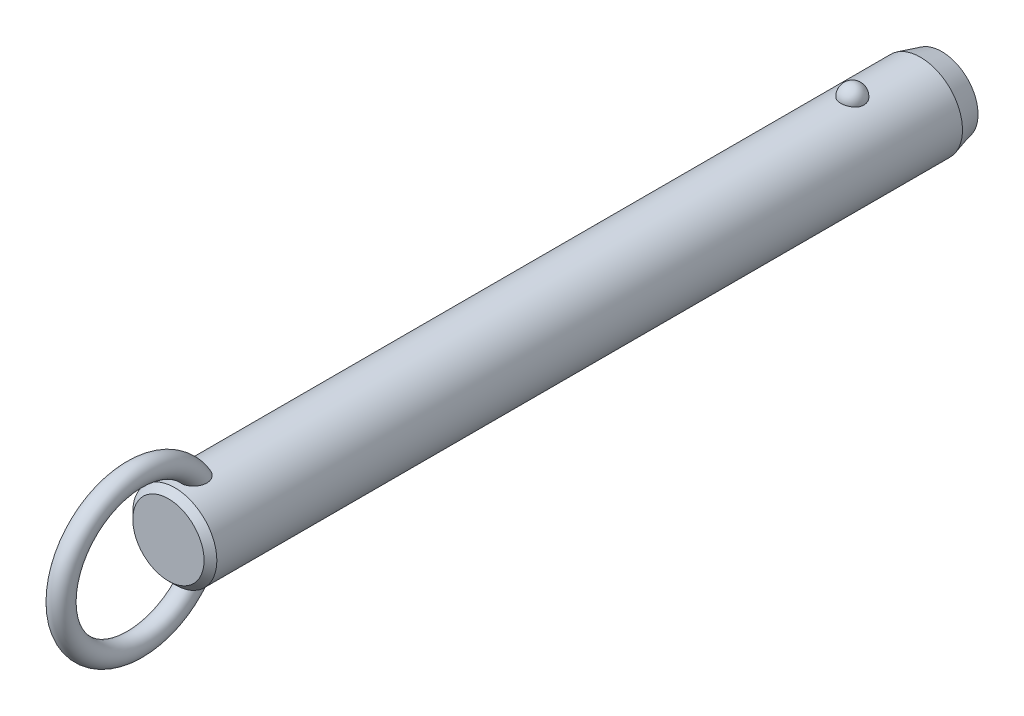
ISO-10303-21;
HEADER;
FILE_DESCRIPTION(('STEP AP214'),'2;1');
FILE_NAME('part.step','',(''),(''),'','','');
FILE_SCHEMA(('AUTOMOTIVE_DESIGN { 1 0 10303 214 1 1 1 1 }'));
ENDSEC;
DATA;
#1=APPLICATION_CONTEXT('core data for automotive mechanical design processes');
#2=APPLICATION_PROTOCOL_DEFINITION('international standard','automotive_design',2000,#1);
#3=PRODUCT_CONTEXT('',#1,'mechanical');
#4=PRODUCT('Part','Part','',(#3));
#5=PRODUCT_RELATED_PRODUCT_CATEGORY('part','',(#4));
#6=PRODUCT_DEFINITION_FORMATION('','',#4);
#7=PRODUCT_DEFINITION_CONTEXT('part definition',#1,'design');
#8=PRODUCT_DEFINITION('design','',#6,#7);
#9=PRODUCT_DEFINITION_SHAPE('','',#8);
#10=(LENGTH_UNIT() NAMED_UNIT(*) SI_UNIT(.MILLI.,.METRE.));
#11=(NAMED_UNIT(*) PLANE_ANGLE_UNIT() SI_UNIT($,.RADIAN.));
#12=(NAMED_UNIT(*) SI_UNIT($,.STERADIAN.) SOLID_ANGLE_UNIT());
#13=UNCERTAINTY_MEASURE_WITH_UNIT(LENGTH_MEASURE(1.E-05),#10,'distance_accuracy_value','');
#14=(GEOMETRIC_REPRESENTATION_CONTEXT(3) GLOBAL_UNCERTAINTY_ASSIGNED_CONTEXT((#13)) GLOBAL_UNIT_ASSIGNED_CONTEXT((#10,
#11,#12)) REPRESENTATION_CONTEXT('',''));
#15=CARTESIAN_POINT('',(0.,0.,0.));
#16=DIRECTION('',(0.,0.,1.));
#17=DIRECTION('',(1.,0.,0.));
#18=AXIS2_PLACEMENT_3D('',#15,#16,#17);
#19=CARTESIAN_POINT('',(0.,0.,116.8));
#20=DIRECTION('',(0.,0.,-1.));
#21=DIRECTION('',(-1.,0.,0.));
#22=AXIS2_PLACEMENT_3D('',#19,#20,#21);
#23=CYLINDRICAL_SURFACE('',#22,7.9);
#24=CARTESIAN_POINT('',(2.1785689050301,7.59367088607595,-2.19999999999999));
#25=CARTESIAN_POINT('',(2.17856679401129,7.59367269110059,-2.07701843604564));
#26=CARTESIAN_POINT('',(2.16853481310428,7.59657145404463,-1.95401006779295));
#27=CARTESIAN_POINT('',(2.12864689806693,7.607843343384,-1.71147811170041));
#28=CARTESIAN_POINT('',(2.09878338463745,7.61621856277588,-1.59195587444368));
#29=CARTESIAN_POINT('',(2.0199931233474,7.63749180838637,-1.3598563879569));
#30=CARTESIAN_POINT('',(1.97107475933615,7.6503878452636,-1.24727610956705));
#31=CARTESIAN_POINT('',(1.85539377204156,7.67926115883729,-1.03213234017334));
#32=CARTESIAN_POINT('',(1.78863158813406,7.69523835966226,-0.929568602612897));
#33=CARTESIAN_POINT('',(1.63856494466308,7.7285848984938,-0.736786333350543));
#34=CARTESIAN_POINT('',(1.55518140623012,7.7459606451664,-0.646630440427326));
#35=CARTESIAN_POINT('',(1.37422937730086,7.78009978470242,-0.481747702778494));
#36=CARTESIAN_POINT('',(1.27666086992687,7.79686317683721,-0.407020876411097));
#37=CARTESIAN_POINT('',(1.07024728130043,7.82786153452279,-0.275278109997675));
#38=CARTESIAN_POINT('',(0.961434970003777,7.84210353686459,-0.218212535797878));
#39=CARTESIAN_POINT('',(0.735351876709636,7.86652194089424,-0.123146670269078));
#40=CARTESIAN_POINT('',(0.618082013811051,7.87669878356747,-0.085144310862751));
#41=CARTESIAN_POINT('',(0.380637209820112,7.89170521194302,-0.0298158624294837));
#42=CARTESIAN_POINT('',(0.260550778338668,7.89662650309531,-0.0121347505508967));
#43=CARTESIAN_POINT('',(0.0190117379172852,7.90090003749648,0.00324379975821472));
#44=CARTESIAN_POINT('',(-0.102440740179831,7.90025280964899,0.00094313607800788));
#45=CARTESIAN_POINT('',(-0.341452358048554,7.89351056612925,-0.0233955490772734));
#46=CARTESIAN_POINT('',(-0.459042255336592,7.88749257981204,-0.0451545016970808));
#47=CARTESIAN_POINT('',(-0.688796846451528,7.87075812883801,-0.107408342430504));
#48=CARTESIAN_POINT('',(-0.800961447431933,7.86004158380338,-0.147903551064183));
#49=CARTESIAN_POINT('',(-1.01743634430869,7.83497131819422,-0.246799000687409));
#50=CARTESIAN_POINT('',(-1.12169791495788,7.82059709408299,-0.305300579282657));
#51=CARTESIAN_POINT('',(-1.31891765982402,7.78976470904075,-0.438549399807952));
#52=CARTESIAN_POINT('',(-1.41187469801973,7.77330633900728,-0.513298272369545));
#53=CARTESIAN_POINT('',(-1.58577142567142,7.73972434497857,-0.678622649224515));
#54=CARTESIAN_POINT('',(-1.66645140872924,7.72259402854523,-0.769470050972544));
#55=CARTESIAN_POINT('',(-1.81161503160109,7.68983776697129,-0.963538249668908));
#56=CARTESIAN_POINT('',(-1.87609753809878,7.6742119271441,-1.06675991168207));
#57=CARTESIAN_POINT('',(-1.98790138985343,7.6460202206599,-1.28401170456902));
#58=CARTESIAN_POINT('',(-2.03501994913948,7.63349104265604,-1.39815107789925));
#59=CARTESIAN_POINT('',(-2.10986724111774,7.6131449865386,-1.63301784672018));
#60=CARTESIAN_POINT('',(-2.1375965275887,7.60532797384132,-1.75374505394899));
#61=CARTESIAN_POINT('',(-2.17289256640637,7.5953195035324,-1.99782562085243));
#62=CARTESIAN_POINT('',(-2.18054294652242,7.59310471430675,-2.12116592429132));
#63=CARTESIAN_POINT('',(-2.17572919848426,7.59448538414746,-2.36741799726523));
#64=CARTESIAN_POINT('',(-2.1632656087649,7.59808068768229,-2.49032977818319));
#65=CARTESIAN_POINT('',(-2.11865035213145,7.61064035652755,-2.73161015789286));
#66=CARTESIAN_POINT('',(-2.08659579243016,7.61957823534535,-2.84999812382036));
#67=CARTESIAN_POINT('',(-2.00367799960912,7.64179982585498,-3.07955956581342));
#68=CARTESIAN_POINT('',(-1.9528140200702,7.65508371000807,-3.19073275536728));
#69=CARTESIAN_POINT('',(-1.83321113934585,7.68460381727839,-3.40337899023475));
#70=CARTESIAN_POINT('',(-1.76437735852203,7.70085556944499,-3.50479651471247));
#71=CARTESIAN_POINT('',(-1.61069526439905,7.73445734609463,-3.69446912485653));
#72=CARTESIAN_POINT('',(-1.52584634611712,7.75180741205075,-3.78272371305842));
#73=CARTESIAN_POINT('',(-1.34198059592,7.78574608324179,-3.94393987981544));
#74=CARTESIAN_POINT('',(-1.24291308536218,7.80233167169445,-4.01684434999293));
#75=CARTESIAN_POINT('',(-1.03352039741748,7.83281625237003,-4.14489386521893));
#76=CARTESIAN_POINT('',(-0.92319600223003,7.84671543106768,-4.20004014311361));
#77=CARTESIAN_POINT('',(-0.695822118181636,7.87011575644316,-4.29042017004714));
#78=CARTESIAN_POINT('',(-0.578872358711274,7.87966903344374,-4.32589112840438));
#79=CARTESIAN_POINT('',(-0.340410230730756,7.8935652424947,-4.37692226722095));
#80=CARTESIAN_POINT('',(-0.218898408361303,7.89790879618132,-4.39248482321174));
#81=CARTESIAN_POINT('',(0.0228107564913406,7.90087453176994,-4.40314405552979));
#82=CARTESIAN_POINT('',(0.142990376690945,7.89960185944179,-4.39861683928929));
#83=CARTESIAN_POINT('',(0.380829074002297,7.89171262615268,-4.37008293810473));
#84=CARTESIAN_POINT('',(0.498488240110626,7.8850962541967,-4.34607694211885));
#85=CARTESIAN_POINT('',(0.727535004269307,7.86726442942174,-4.27939317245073));
#86=CARTESIAN_POINT('',(0.838944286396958,7.85606616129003,-4.236785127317));
#87=CARTESIAN_POINT('',(1.05295421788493,7.83025654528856,-4.13408348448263));
#88=CARTESIAN_POINT('',(1.15555431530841,7.81564498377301,-4.07398879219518));
#89=CARTESIAN_POINT('',(1.35076763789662,7.7843022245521,-3.93687432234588));
#90=CARTESIAN_POINT('',(1.4432046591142,7.76754209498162,-3.85961036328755));
#91=CARTESIAN_POINT('',(1.6139111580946,7.73387857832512,-3.69076949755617));
#92=CARTESIAN_POINT('',(1.6921781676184,7.71697516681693,-3.59919010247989));
#93=CARTESIAN_POINT('',(1.83380875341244,7.6845643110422,-3.40247278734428));
#94=CARTESIAN_POINT('',(1.89689280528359,7.66908588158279,-3.29712873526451));
#95=CARTESIAN_POINT('',(2.0047823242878,7.64159441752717,-3.07707931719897));
#96=CARTESIAN_POINT('',(2.0495945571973,7.62958010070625,-2.96237743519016));
#97=CARTESIAN_POINT('',(2.11580183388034,7.61146617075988,-2.74040519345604));
#98=CARTESIAN_POINT('',(2.13929812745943,7.60484503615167,-2.63379846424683));
#99=CARTESIAN_POINT('',(2.17068242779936,7.59594664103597,-2.41813481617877));
#100=CARTESIAN_POINT('',(2.17857077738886,7.59366928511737,-2.30907795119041));
#101=CARTESIAN_POINT('',(2.1785689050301,7.59367088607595,-2.19999999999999));
#102=B_SPLINE_CURVE_WITH_KNOTS('',3,(#24,#25,#26,#27,#28,#29,#30,#31,#32,#33,#34,#35,#36,#37,
#38,#39,#40,#41,#42,#43,#44,#45,#46,#47,#48,#49,#50,#51,#52,#53,#54,#55,#56,#57,#58,#59,#60,#61,
#62,#63,#64,#65,#66,#67,#68,#69,#70,#71,#72,#73,#74,#75,#76,#77,#78,#79,#80,#81,#82,#83,#84,#85,
#86,#87,#88,#89,#90,#91,#92,#93,#94,#95,#96,#97,#98,#99,#100,#101),.UNSPECIFIED.,.T.,.F.,(4,2,2,
2,2,2,2,2,2,2,2,2,2,2,2,2,2,2,2,2,2,2,2,2,2,2,2,2,2,2,2,2,2,2,2,2,2,2,4),(0.,0.368552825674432,
0.737246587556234,1.10577831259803,1.4743009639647,1.8446206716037,2.21494081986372,
2.5842105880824,2.95344028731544,3.31611630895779,3.67875788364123,4.03628044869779,
4.39380913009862,4.75338791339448,5.11300280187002,5.47939989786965,5.8458226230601,
6.21639834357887,6.58696347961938,6.95598276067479,7.32499216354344,7.69218715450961,
8.0593967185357,8.42858578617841,8.79778880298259,9.16834203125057,9.5388695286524,
9.90482699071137,10.2707407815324,10.6298333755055,10.9889132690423,11.3466585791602,
11.7044262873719,12.0676511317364,12.4309391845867,12.8004764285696,13.1698767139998,
13.4967701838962,13.8236564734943),.UNSPECIFIED.);
#103=CARTESIAN_POINT('',(2.1785689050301,7.59367088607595,-2.19999999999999));
#104=VERTEX_POINT('',#103);
#105=EDGE_CURVE('E41',#104,#104,#102,.T.);
#106=ORIENTED_EDGE('',*,*,#105,.T.);
#107=EDGE_LOOP('',(#106));
#108=FACE_BOUND('',#107,.T.);
#109=CARTESIAN_POINT('',(0.,0.,125.12));
#110=DIRECTION('',(0.,0.,1.));
#111=DIRECTION('',(1.,0.,0.));
#112=AXIS2_PLACEMENT_3D('',#109,#110,#111);
#113=CIRCLE('',#112,7.9);
#114=CARTESIAN_POINT('',(7.9,0.,125.12));
#115=VERTEX_POINT('',#114);
#116=EDGE_CURVE('E10',#115,#115,#113,.F.);
#117=ORIENTED_EDGE('',*,*,#116,.T.);
#118=EDGE_LOOP('',(#117));
#119=FACE_BOUND('',#118,.T.);
#120=CARTESIAN_POINT('',(-0.630969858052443,-7.87476203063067,119.012432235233));
#121=CARTESIAN_POINT('',(-0.734180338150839,-7.8664899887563,119.047285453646));
#122=CARTESIAN_POINT('',(-0.834476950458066,-7.85639291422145,119.090816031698));
#123=CARTESIAN_POINT('',(-1.0262035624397,-7.83366343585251,119.194094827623));
#124=CARTESIAN_POINT('',(-1.1176141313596,-7.82102565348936,119.253877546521));
#125=CARTESIAN_POINT('',(-1.28877277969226,-7.79464922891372,119.387839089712));
#126=CARTESIAN_POINT('',(-1.36854014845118,-7.78091246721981,119.461993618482));
#127=CARTESIAN_POINT('',(-1.5146152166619,-7.75380398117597,119.622494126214));
#128=CARTESIAN_POINT('',(-1.58092966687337,-7.74043207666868,119.708833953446));
#129=CARTESIAN_POINT('',(-1.70019064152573,-7.71512522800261,119.892978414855));
#130=CARTESIAN_POINT('',(-1.75284037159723,-7.70322473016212,119.990979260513));
#131=CARTESIAN_POINT('',(-1.84263464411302,-7.68224112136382,120.194102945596));
#132=CARTESIAN_POINT('',(-1.87977299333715,-7.6731591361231,120.299228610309));
#133=CARTESIAN_POINT('',(-1.94152728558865,-7.65777930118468,120.523284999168));
#134=CARTESIAN_POINT('',(-1.96475471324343,-7.65179654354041,120.642616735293));
#135=CARTESIAN_POINT('',(-1.99449499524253,-7.64409642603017,120.88342986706));
#136=CARTESIAN_POINT('',(-2.0010005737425,-7.64238092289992,121.004912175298));
#137=CARTESIAN_POINT('',(-1.99856014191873,-7.64302120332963,121.268340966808));
#138=CARTESIAN_POINT('',(-1.98680021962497,-7.64611845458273,121.41025654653));
#139=CARTESIAN_POINT('',(-1.9445777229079,-7.65696186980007,121.691118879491));
#140=CARTESIAN_POINT('',(-1.91409393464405,-7.66471330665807,121.830062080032));
#141=CARTESIAN_POINT('',(-1.82768670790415,-7.68582947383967,122.131939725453));
#142=CARTESIAN_POINT('',(-1.76772963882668,-7.70003779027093,122.293686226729));
#143=CARTESIAN_POINT('',(-1.65998501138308,-7.72371550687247,122.527695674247));
#144=CARTESIAN_POINT('',(-1.62107967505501,-7.73200670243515,122.604297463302));
#145=CARTESIAN_POINT('',(-1.53727726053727,-7.74910377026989,122.754079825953));
#146=CARTESIAN_POINT('',(-1.49238215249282,-7.75790947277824,122.827261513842));
#147=CARTESIAN_POINT('',(-1.3739705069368,-7.77993338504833,123.00288382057));
#148=CARTESIAN_POINT('',(-1.29690364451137,-7.79328473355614,123.102955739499));
#149=CARTESIAN_POINT('',(-1.1288548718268,-7.81939266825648,123.290714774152));
#150=CARTESIAN_POINT('',(-1.0378992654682,-7.83215032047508,123.378424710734));
#151=CARTESIAN_POINT('',(-0.869532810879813,-7.85231710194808,123.513414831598));
#152=CARTESIAN_POINT('',(-0.795716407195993,-7.86021093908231,123.565076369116));
#153=CARTESIAN_POINT('',(-0.64081313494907,-7.87434920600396,123.656381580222));
#154=CARTESIAN_POINT('',(-0.559737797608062,-7.88059619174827,123.69604389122));
#155=CARTESIAN_POINT('',(-0.406456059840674,-7.88984116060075,123.754300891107));
#156=CARTESIAN_POINT('',(-0.335227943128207,-7.89321892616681,123.775384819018));
#157=CARTESIAN_POINT('',(-0.190193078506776,-7.89804235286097,123.80541418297));
#158=CARTESIAN_POINT('',(-0.116388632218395,-7.89948969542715,123.814370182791));
#159=CARTESIAN_POINT('',(0.0318414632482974,-7.90028409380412,123.819291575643));
#160=CARTESIAN_POINT('',(0.106268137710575,-7.89962640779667,123.815227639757));
#161=CARTESIAN_POINT('',(0.2532906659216,-7.8962818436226,123.794461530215));
#162=CARTESIAN_POINT('',(0.325885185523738,-7.8935935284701,123.777750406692));
#163=CARTESIAN_POINT('',(0.4814417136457,-7.88577340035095,123.728738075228));
#164=CARTESIAN_POINT('',(0.563611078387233,-7.88026321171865,123.694005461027));
#165=CARTESIAN_POINT('',(0.721129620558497,-7.86741729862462,123.611796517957));
#166=CARTESIAN_POINT('',(0.79646633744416,-7.86007832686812,123.564297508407));
#167=CARTESIAN_POINT('',(0.971456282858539,-7.84073285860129,123.436513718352));
#168=CARTESIAN_POINT('',(1.06719686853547,-7.82809461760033,123.351004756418));
#169=CARTESIAN_POINT('',(1.24418921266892,-7.80192439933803,123.166232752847));
#170=CARTESIAN_POINT('',(1.32540832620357,-7.78839049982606,123.066939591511));
#171=CARTESIAN_POINT('',(1.45199971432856,-7.76559693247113,122.889576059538));
#172=CARTESIAN_POINT('',(1.50085649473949,-7.75626094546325,122.813954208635));
#173=CARTESIAN_POINT('',(1.59197749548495,-7.7380727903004,122.658742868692));
#174=CARTESIAN_POINT('',(1.63423919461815,-7.72922080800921,122.579151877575));
#175=CARTESIAN_POINT('',(1.7122261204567,-7.71231959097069,122.416664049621));
#176=CARTESIAN_POINT('',(1.74794516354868,-7.70427111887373,122.333764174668));
#177=CARTESIAN_POINT('',(1.81270113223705,-7.68929240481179,122.1652967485));
#178=CARTESIAN_POINT('',(1.84173789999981,-7.68236218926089,122.079729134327));
#179=CARTESIAN_POINT('',(1.89322698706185,-7.6698375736,121.90528702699));
#180=CARTESIAN_POINT('',(1.91558744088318,-7.66426199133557,121.816383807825));
#181=CARTESIAN_POINT('',(1.95281367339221,-7.65485915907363,121.636969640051));
#182=CARTESIAN_POINT('',(1.96767946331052,-7.65103190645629,121.546458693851));
#183=CARTESIAN_POINT('',(2.00021456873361,-7.64262981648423,121.273732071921));
#184=CARTESIAN_POINT('',(2.00600691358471,-7.6410871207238,121.089709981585));
#185=CARTESIAN_POINT('',(1.98445334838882,-7.64669564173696,120.776501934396));
#186=CARTESIAN_POINT('',(1.96607186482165,-7.65149688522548,120.646618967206));
#187=CARTESIAN_POINT('',(1.90884967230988,-7.6659762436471,120.391632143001));
#188=CARTESIAN_POINT('',(1.87002101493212,-7.67565148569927,120.266525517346));
#189=CARTESIAN_POINT('',(1.77063986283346,-7.69918471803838,120.02454013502));
#190=CARTESIAN_POINT('',(1.70993724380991,-7.71307150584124,119.907725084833));
#191=CARTESIAN_POINT('',(1.56733070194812,-7.74330306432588,119.688144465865));
#192=CARTESIAN_POINT('',(1.48543692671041,-7.75964665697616,119.585372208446));
#193=CARTESIAN_POINT('',(1.31346177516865,-7.79047523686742,119.409380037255));
#194=CARTESIAN_POINT('',(1.22547278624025,-7.80495298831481,119.334106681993));
#195=CARTESIAN_POINT('',(1.03724352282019,-7.83218597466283,119.200486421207));
#196=CARTESIAN_POINT('',(0.937008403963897,-7.84494192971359,119.142132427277));
#197=CARTESIAN_POINT('',(0.733599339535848,-7.86649045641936,119.047027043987));
#198=CARTESIAN_POINT('',(0.630941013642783,-7.87547134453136,119.009210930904));
#199=CARTESIAN_POINT('',(0.420465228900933,-7.88950708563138,118.951116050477));
#200=CARTESIAN_POINT('',(0.312645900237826,-7.89456050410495,118.93084369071));
#201=CARTESIAN_POINT('',(0.0960869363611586,-7.9001518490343,118.908455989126));
#202=CARTESIAN_POINT('',(-0.0126341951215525,-7.90073226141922,118.906169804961));
#203=CARTESIAN_POINT('',(-0.228766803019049,-7.89742350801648,118.919367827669));
#204=CARTESIAN_POINT('',(-0.33618060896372,-7.89354403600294,118.934813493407));
#205=CARTESIAN_POINT('',(-0.473410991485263,-7.88586871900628,118.966217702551));
#206=CARTESIAN_POINT('',(-0.505257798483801,-7.88388984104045,118.974354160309));
#207=CARTESIAN_POINT('',(-0.568481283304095,-7.87958326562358,118.992208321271));
#208=CARTESIAN_POINT('',(-0.599857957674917,-7.87725556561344,119.001926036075));
#209=CARTESIAN_POINT('',(-0.630969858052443,-7.87476203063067,119.012432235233));
#210=B_SPLINE_CURVE_WITH_KNOTS('',3,(#120,#121,#122,#123,#124,#125,#126,#127,#128,#129,#130,
#131,#132,#133,#134,#135,#136,#137,#138,#139,#140,#141,#142,#143,#144,#145,#146,#147,#148,#149,
#150,#151,#152,#153,#154,#155,#156,#157,#158,#159,#160,#161,#162,#163,#164,#165,#166,#167,#168,
#169,#170,#171,#172,#173,#174,#175,#176,#177,#178,#179,#180,#181,#182,#183,#184,#185,#186,#187,
#188,#189,#190,#191,#192,#193,#194,#195,#196,#197,#198,#199,#200,#201,#202,#203,#204,#205,#206,
#207,#208,#209),.UNSPECIFIED.,.T.,.F.,(4,2,2,2,2,2,2,2,2,2,2,2,2,2,2,2,2,2,2,2,2,2,2,2,2,2,2,2,
2,2,2,2,2,2,2,2,2,2,2,2,2,2,2,2,4),(0.,0.327622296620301,0.655945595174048,0.983718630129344,
1.3113267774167,1.64554655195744,1.9798996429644,2.34365728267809,2.70757317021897,
3.13333684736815,3.55958380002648,4.07655306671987,4.33527897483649,4.59391999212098,
4.97382437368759,5.35301797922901,5.62348245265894,5.89352465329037,6.11565959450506,
6.3376009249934,6.56004255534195,6.782641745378,7.04930844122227,7.31645206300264,
7.70130871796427,8.08701995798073,8.35824509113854,8.62957365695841,8.90115735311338,
9.17274746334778,9.44791855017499,9.72308922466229,10.2715298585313,10.6638393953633,
11.0559179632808,11.4507403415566,11.845374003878,12.1936425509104,12.5417649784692,
12.8695063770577,13.1973674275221,13.5221104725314,13.8461490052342,13.9449071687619,
14.0436660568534),.UNSPECIFIED.);
#211=CARTESIAN_POINT('',(-0.630969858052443,-7.87476203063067,119.012432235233));
#212=VERTEX_POINT('',#211);
#213=EDGE_CURVE('E59',#212,#212,#210,.T.);
#214=ORIENTED_EDGE('',*,*,#213,.T.);
#215=EDGE_LOOP('',(#214));
#216=FACE_BOUND('',#215,.T.);
#217=CARTESIAN_POINT('',(-0.630969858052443,7.87476203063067,119.012432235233));
#218=CARTESIAN_POINT('',(-0.528918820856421,7.88293636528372,118.977979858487));
#219=CARTESIAN_POINT('',(-0.42374551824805,7.8893481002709,118.951915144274));
#220=CARTESIAN_POINT('',(-0.210236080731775,7.8979273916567,118.917282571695));
#221=CARTESIAN_POINT('',(-0.101893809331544,7.90008607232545,118.908751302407));
#222=CARTESIAN_POINT('',(0.114660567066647,7.89990877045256,118.909457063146));
#223=CARTESIAN_POINT('',(0.222872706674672,7.89757640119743,118.91867980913));
#224=CARTESIAN_POINT('',(0.436107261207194,7.88867538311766,118.954652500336));
#225=CARTESIAN_POINT('',(0.541131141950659,7.8821087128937,118.98139425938));
#226=CARTESIAN_POINT('',(0.745085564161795,7.86545130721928,119.051756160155));
#227=CARTESIAN_POINT('',(0.844015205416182,7.85536005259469,119.095378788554));
#228=CARTESIAN_POINT('',(1.03299167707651,7.83275153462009,119.198379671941));
#229=CARTESIAN_POINT('',(1.12303841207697,7.8202342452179,119.257758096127));
#230=CARTESIAN_POINT('',(1.29214734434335,7.79408219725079,119.390864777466));
#231=CARTESIAN_POINT('',(1.37116907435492,7.78044359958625,119.464643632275));
#232=CARTESIAN_POINT('',(1.51597677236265,7.75353170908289,119.624235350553));
#233=CARTESIAN_POINT('',(1.58176261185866,7.74025841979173,119.710048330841));
#234=CARTESIAN_POINT('',(1.70057386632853,7.71504069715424,119.893644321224));
#235=CARTESIAN_POINT('',(1.75320073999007,7.7031425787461,119.991690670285));
#236=CARTESIAN_POINT('',(1.8429376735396,7.68216822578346,120.194893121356));
#237=CARTESIAN_POINT('',(1.88004278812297,7.67309289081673,120.300051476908));
#238=CARTESIAN_POINT('',(1.9417232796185,7.6577294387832,120.524167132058));
#239=CARTESIAN_POINT('',(1.96491037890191,7.65175648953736,120.643524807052));
#240=CARTESIAN_POINT('',(1.9945689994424,7.64407702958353,120.884384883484));
#241=CARTESIAN_POINT('',(2.00103304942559,7.64237242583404,121.00588821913));
#242=CARTESIAN_POINT('',(1.99850166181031,7.64303650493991,121.269368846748));
#243=CARTESIAN_POINT('',(1.98669038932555,7.64614714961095,121.411314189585));
#244=CARTESIAN_POINT('',(1.94436120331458,7.6570170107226,121.692228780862));
#245=CARTESIAN_POINT('',(1.91382203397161,7.66478150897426,121.831194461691));
#246=CARTESIAN_POINT('',(1.82728754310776,7.68592483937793,122.133111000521));
#247=CARTESIAN_POINT('',(1.76725778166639,7.7001468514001,122.294872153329));
#248=CARTESIAN_POINT('',(1.65939700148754,7.72384204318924,122.528891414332));
#249=CARTESIAN_POINT('',(1.62045187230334,7.73213852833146,122.605494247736));
#250=CARTESIAN_POINT('',(1.53656684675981,7.74924489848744,122.755273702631));
#251=CARTESIAN_POINT('',(1.49162892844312,7.75805461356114,122.828451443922));
#252=CARTESIAN_POINT('',(1.37317698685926,7.78007342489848,123.003952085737));
#253=CARTESIAN_POINT('',(1.29612360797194,7.79341423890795,123.103911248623));
#254=CARTESIAN_POINT('',(1.12812043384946,7.81949839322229,123.29145083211));
#255=CARTESIAN_POINT('',(1.03719688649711,7.83224280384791,123.379054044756));
#256=CARTESIAN_POINT('',(0.868871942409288,7.85239026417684,123.51389715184));
#257=CARTESIAN_POINT('',(0.795056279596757,7.86027769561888,123.565511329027));
#258=CARTESIAN_POINT('',(0.640160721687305,7.87440222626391,123.656720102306));
#259=CARTESIAN_POINT('',(0.559092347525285,7.88064188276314,123.696333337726));
#260=CARTESIAN_POINT('',(0.405820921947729,7.8898738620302,123.754505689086));
#261=CARTESIAN_POINT('',(0.334594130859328,7.89324577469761,123.775552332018));
#262=CARTESIAN_POINT('',(0.189568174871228,7.89805733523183,123.805507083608));
#263=CARTESIAN_POINT('',(0.115771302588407,7.89949866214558,123.814425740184));
#264=CARTESIAN_POINT('',(-0.0324359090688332,7.90028156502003,123.81927589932));
#265=CARTESIAN_POINT('',(-0.106847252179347,7.89961843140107,123.815178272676));
#266=CARTESIAN_POINT('',(-0.253834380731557,7.8962642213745,123.794351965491));
#267=CARTESIAN_POINT('',(-0.326408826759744,7.89357170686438,123.777614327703));
#268=CARTESIAN_POINT('',(-0.48196226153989,7.88574179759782,123.728539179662));
#269=CARTESIAN_POINT('',(-0.564145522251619,7.88022507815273,123.693763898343));
#270=CARTESIAN_POINT('',(-0.72168526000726,7.8673664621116,123.611468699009));
#271=CARTESIAN_POINT('',(-0.797029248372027,7.8600213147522,123.563926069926));
#272=CARTESIAN_POINT('',(-0.972044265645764,7.84066026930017,123.436026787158));
#273=CARTESIAN_POINT('',(-1.06779803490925,7.82801274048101,123.350443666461));
#274=CARTESIAN_POINT('',(-1.24480531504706,7.80182621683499,123.165522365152));
#275=CARTESIAN_POINT('',(-1.32602618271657,7.78828530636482,123.066154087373));
#276=CARTESIAN_POINT('',(-1.45259834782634,7.76548487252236,122.888680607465));
#277=CARTESIAN_POINT('',(-1.50143856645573,7.75614818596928,122.813025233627));
#278=CARTESIAN_POINT('',(-1.59252410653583,7.7379602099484,122.657748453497));
#279=CARTESIAN_POINT('',(-1.63476690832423,7.72910910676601,122.578125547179));
#280=CARTESIAN_POINT('',(-1.71271318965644,7.71221133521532,122.415575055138));
#281=CARTESIAN_POINT('',(-1.74841047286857,7.70416543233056,122.332644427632));
#282=CARTESIAN_POINT('',(-1.81311929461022,7.68919371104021,122.164116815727));
#283=CARTESIAN_POINT('',(-1.84213067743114,7.6822679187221,122.078519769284));
#284=CARTESIAN_POINT('',(-1.89356259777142,7.66975461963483,121.904025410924));
#285=CARTESIAN_POINT('',(-1.91589165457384,7.66418586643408,121.815099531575));
#286=CARTESIAN_POINT('',(-1.95305070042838,7.65479859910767,121.635642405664));
#287=CARTESIAN_POINT('',(-1.96788069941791,7.65098008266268,121.545111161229));
#288=CARTESIAN_POINT('',(-2.00030078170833,7.64260704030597,121.272327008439));
#289=CARTESIAN_POINT('',(-2.00600576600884,7.64108760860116,121.088271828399));
#290=CARTESIAN_POINT('',(-1.98428483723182,7.64673945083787,120.775080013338));
#291=CARTESIAN_POINT('',(-1.96583698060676,7.6515575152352,120.645240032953));
#292=CARTESIAN_POINT('',(-1.9084894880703,7.66606613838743,120.390361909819));
#293=CARTESIAN_POINT('',(-1.86960376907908,7.67575338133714,120.265320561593));
#294=CARTESIAN_POINT('',(-1.77013421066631,7.69930132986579,120.023500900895));
#295=CARTESIAN_POINT('',(-1.7094048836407,7.71318991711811,119.906784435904));
#296=CARTESIAN_POINT('',(-1.56672953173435,7.74342495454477,119.687340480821));
#297=CARTESIAN_POINT('',(-1.48478316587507,7.75977144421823,119.58461321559));
#298=CARTESIAN_POINT('',(-1.31266325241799,7.79061163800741,119.408643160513));
#299=CARTESIAN_POINT('',(-1.22456383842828,7.80509908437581,119.333358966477));
#300=CARTESIAN_POINT('',(-1.03622400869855,7.83231881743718,119.199865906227));
#301=CARTESIAN_POINT('',(-0.936015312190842,7.84505551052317,119.141613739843));
#302=CARTESIAN_POINT('',(-0.798824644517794,7.85957802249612,119.077540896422));
#303=CARTESIAN_POINT('',(-0.765787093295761,7.8628682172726,119.063224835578));
#304=CARTESIAN_POINT('',(-0.698939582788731,7.86909211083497,119.036436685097));
#305=CARTESIAN_POINT('',(-0.665129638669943,7.8720258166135,119.023964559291));
#306=CARTESIAN_POINT('',(-0.630969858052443,7.87476203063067,119.012432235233));
#307=B_SPLINE_CURVE_WITH_KNOTS('',3,(#217,#218,#219,#220,#221,#222,#223,#224,#225,#226,#227,
#228,#229,#230,#231,#232,#233,#234,#235,#236,#237,#238,#239,#240,#241,#242,#243,#244,#245,#246,
#247,#248,#249,#250,#251,#252,#253,#254,#255,#256,#257,#258,#259,#260,#261,#262,#263,#264,#265,
#266,#267,#268,#269,#270,#271,#272,#273,#274,#275,#276,#277,#278,#279,#280,#281,#282,#283,#284,
#285,#286,#287,#288,#289,#290,#291,#292,#293,#294,#295,#296,#297,#298,#299,#300,#301,#302,#303,
#304,#305,#306),.UNSPECIFIED.,.T.,.F.,(4,2,2,2,2,2,2,2,2,2,2,2,2,2,2,2,2,2,2,2,2,2,2,2,2,2,2,2,
2,2,2,2,2,2,2,2,2,2,2,2,2,2,2,2,4),(0.,0.323920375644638,0.648516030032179,0.97285063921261,
1.29703380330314,1.62126473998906,1.94549915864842,2.27089401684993,2.5962920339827,
2.93059633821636,3.26500707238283,3.6288164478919,3.99278833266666,4.41865421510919,
4.84500434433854,5.36209210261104,5.62087589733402,5.87957448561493,6.2591859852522,
6.63808782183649,6.90846748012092,7.17842501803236,7.40052350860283,7.62242871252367,
7.84483086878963,8.06739077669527,8.33414615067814,8.60137921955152,8.98641454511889,
9.37230415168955,9.64358673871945,9.9149726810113,10.1866142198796,10.458262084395,
10.7334745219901,11.0086865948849,11.5572126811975,11.9494246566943,12.3413699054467,
12.7359755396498,13.1305875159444,13.4791770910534,13.82687259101,13.9353013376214,
14.0437279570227),.UNSPECIFIED.);
#308=CARTESIAN_POINT('',(-0.630969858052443,7.87476203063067,119.012432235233));
#309=VERTEX_POINT('',#308);
#310=EDGE_CURVE('E67',#309,#309,#307,.T.);
#311=ORIENTED_EDGE('',*,*,#310,.T.);
#312=EDGE_LOOP('',(#311));
#313=FACE_BOUND('',#312,.T.);
#314=CARTESIAN_POINT('',(0.,0.,-14.9999999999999));
#315=DIRECTION('',(0.,0.,-1.));
#316=DIRECTION('',(-1.,0.,0.));
#317=AXIS2_PLACEMENT_3D('',#314,#315,#316);
#318=CIRCLE('',#317,7.9);
#319=CARTESIAN_POINT('',(-7.9,0.,-14.9999999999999));
#320=VERTEX_POINT('',#319);
#321=EDGE_CURVE('E56',#320,#320,#318,.F.);
#322=ORIENTED_EDGE('',*,*,#321,.T.);
#323=EDGE_LOOP('',(#322));
#324=FACE_BOUND('',#323,.T.);
#325=ADVANCED_FACE('F37',(#108,#119,#216,#313,#324),#23,.T.);
#326=CARTESIAN_POINT('',(0.,0.,-19.));
#327=DIRECTION('',(0.,0.,-1.));
#328=DIRECTION('',(-1.,0.,0.));
#329=AXIS2_PLACEMENT_3D('',#326,#327,#328);
#330=PLANE('',#329);
#331=CARTESIAN_POINT('',(0.,0.,-19.));
#332=DIRECTION('',(0.,0.,-1.));
#333=DIRECTION('',(-1.,0.,0.));
#334=AXIS2_PLACEMENT_3D('',#331,#332,#333);
#335=CIRCLE('',#334,6.82820323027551);
#336=CARTESIAN_POINT('',(-6.82820323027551,0.,-19.));
#337=VERTEX_POINT('',#336);
#338=EDGE_CURVE('E66',#337,#337,#335,.T.);
#339=ORIENTED_EDGE('',*,*,#338,.T.);
#340=EDGE_LOOP('',(#339));
#341=FACE_BOUND('',#340,.T.);
#342=ADVANCED_FACE('F85',(#341),#330,.T.);
#343=CARTESIAN_POINT('',(0.,0.,-19.));
#344=DIRECTION('',(0.,0.,1.));
#345=DIRECTION('',(1.,0.,0.));
#346=AXIS2_PLACEMENT_3D('',#343,#344,#345);
#347=CONICAL_SURFACE('',#346,6.8282032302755,0.261799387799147);
#348=ORIENTED_EDGE('',*,*,#321,.F.);
#349=EDGE_LOOP('',(#348));
#350=FACE_BOUND('',#349,.T.);
#351=ORIENTED_EDGE('',*,*,#338,.F.);
#352=EDGE_LOOP('',(#351));
#353=FACE_BOUND('',#352,.T.);
#354=ADVANCED_FACE('F83',(#350,#353),#347,.T.);
#355=CARTESIAN_POINT('',(0.,0.,126.32));
#356=DIRECTION('',(0.,0.,1.));
#357=DIRECTION('',(1.,0.,0.));
#358=AXIS2_PLACEMENT_3D('',#355,#356,#357);
#359=PLANE('',#358);
#360=CARTESIAN_POINT('',(0.,0.,126.32));
#361=DIRECTION('',(0.,0.,1.));
#362=DIRECTION('',(1.,0.,0.));
#363=AXIS2_PLACEMENT_3D('',#360,#361,#362);
#364=CIRCLE('',#363,6.70000000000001);
#365=CARTESIAN_POINT('',(6.70000000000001,0.,126.32));
#366=VERTEX_POINT('',#365);
#367=EDGE_CURVE('E50',#366,#366,#364,.T.);
#368=ORIENTED_EDGE('',*,*,#367,.T.);
#369=EDGE_LOOP('',(#368));
#370=FACE_BOUND('',#369,.T.);
#371=ADVANCED_FACE('F77',(#370),#359,.T.);
#372=CARTESIAN_POINT('',(0.,0.,132.65));
#373=DIRECTION('',(1.,0.,0.));
#374=DIRECTION('',(0.,0.,-1.));
#375=AXIS2_PLACEMENT_3D('',#372,#373,#374);
#376=TOROIDAL_SURFACE('',#375,13.85,2.);
#377=ORIENTED_EDGE('',*,*,#310,.F.);
#378=EDGE_LOOP('',(#377));
#379=FACE_BOUND('',#378,.T.);
#380=ORIENTED_EDGE('',*,*,#213,.F.);
#381=EDGE_LOOP('',(#380));
#382=FACE_BOUND('',#381,.T.);
#383=ADVANCED_FACE('F73',(#379,#382),#376,.T.);
#384=CARTESIAN_POINT('',(0.,0.,126.32));
#385=DIRECTION('',(0.,0.,-1.));
#386=DIRECTION('',(-1.,0.,0.));
#387=AXIS2_PLACEMENT_3D('',#384,#385,#386);
#388=CONICAL_SURFACE('',#387,6.70000000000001,0.785398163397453);
#389=ORIENTED_EDGE('',*,*,#116,.F.);
#390=EDGE_LOOP('',(#389));
#391=FACE_BOUND('',#390,.T.);
#392=ORIENTED_EDGE('',*,*,#367,.F.);
#393=EDGE_LOOP('',(#392));
#394=FACE_BOUND('',#393,.T.);
#395=ADVANCED_FACE('F39',(#391,#394),#388,.T.);
#396=CARTESIAN_POINT('',(0.,7.9,-2.19999999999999));
#397=DIRECTION('',(0.,1.,0.));
#398=DIRECTION('',(0.,0.,-1.));
#399=AXIS2_PLACEMENT_3D('',#396,#397,#398);
#400=SPHERICAL_SURFACE('',#399,2.2);
#401=ORIENTED_EDGE('',*,*,#105,.F.);
#402=EDGE_LOOP('',(#401));
#403=FACE_BOUND('',#402,.T.);
#404=ADVANCED_FACE('F79',(#403),#400,.T.);
#405=CLOSED_SHELL('',(#325,#342,#354,#371,#383,#395,#404));
#406=MANIFOLD_SOLID_BREP('B2',#405);
#407=ADVANCED_BREP_SHAPE_REPRESENTATION('',(#18,#406),#14);
#408=SHAPE_DEFINITION_REPRESENTATION(#9,#407);
ENDSEC;
END-ISO-10303-21;
